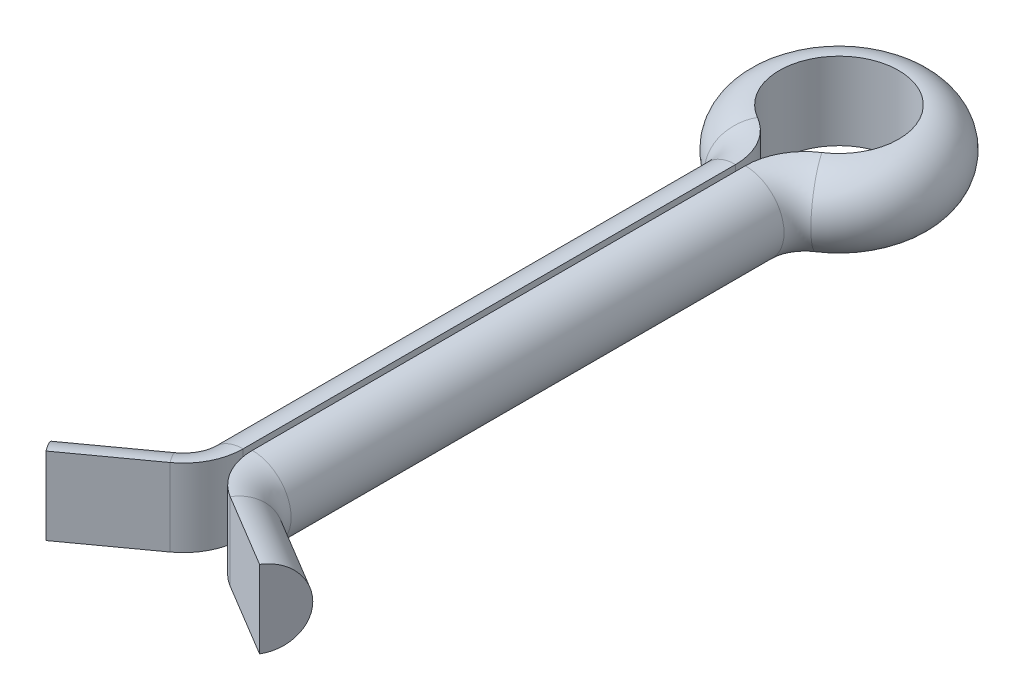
from build123d import *


with BuildPart() as part:
    # Balayage3: sweep along a path in Esquisse2
    with BuildLine(Plane(origin=(0, 0, 0), x_dir=(1, 0, 0), z_dir=(0, 1, 0))) as balayage3_path:
        Line((-3.241240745, -2.344004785), (-0.827997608, -0.598792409))
        ThreePointArc((-0.827997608, -0.598792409), (-0.21898838, 0.111884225), (0, 1.021827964))
        Line((0, 1.021827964), (0, 17.535898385))
        ThreePointArc((0, 17.535898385), (-0.267949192, 18.535898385), (-1, 19.267949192))
        ThreePointArc((-1, 19.267949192), (-0.058757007, 22.999136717), (1.1, 19.329670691))
        ThreePointArc((1.1, 19.329670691), (0.439318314, 18.60802468), (0.2, 17.659341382))
        Line((0.2, 17.659341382), (0.2, 1.133248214))
        ThreePointArc((0.2, 1.133248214), (0.459923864, 0.147279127), (1.172135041, -0.582413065))
        Line((1.172135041, -0.582413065), (3.631322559, -2.055729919))
    # Esquisse3 → Balayage3 (sweep)
    with BuildSketch(Plane(origin=(3.631322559, 0, 2.055729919), x_dir=(0.5139324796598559, 0, -0.8578306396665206), z_dir=(0.8578306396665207, 0, 0.5139324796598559))):
        with BuildLine():
            Line((0, 1.3), (0, -1.3))
            ThreePointArc((0, -1.3), (1.3, 0), (0, 1.3))
        make_face()
    sweep(path=balayage3_path.line)


solid = part.part
